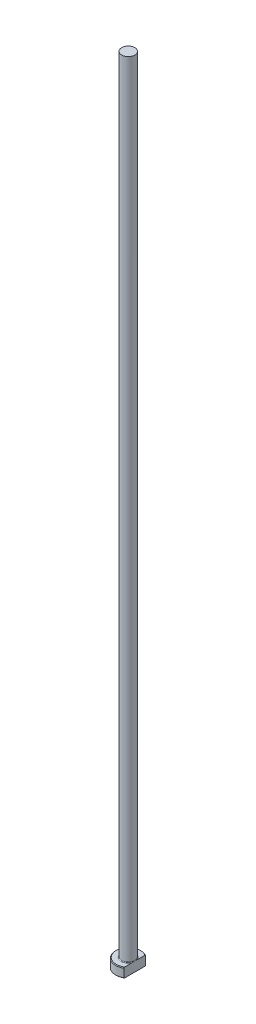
ISO-10303-21;
HEADER;
FILE_DESCRIPTION(('STEP AP214'),'2;1');
FILE_NAME('part.step','',(''),(''),'','','');
FILE_SCHEMA(('AUTOMOTIVE_DESIGN { 1 0 10303 214 1 1 1 1 }'));
ENDSEC;
DATA;
#1=APPLICATION_CONTEXT('core data for automotive mechanical design processes');
#2=APPLICATION_PROTOCOL_DEFINITION('international standard','automotive_design',2000,#1);
#3=PRODUCT_CONTEXT('',#1,'mechanical');
#4=PRODUCT('Part','Part','',(#3));
#5=PRODUCT_RELATED_PRODUCT_CATEGORY('part','',(#4));
#6=PRODUCT_DEFINITION_FORMATION('','',#4);
#7=PRODUCT_DEFINITION_CONTEXT('part definition',#1,'design');
#8=PRODUCT_DEFINITION('design','',#6,#7);
#9=PRODUCT_DEFINITION_SHAPE('','',#8);
#10=(LENGTH_UNIT() NAMED_UNIT(*) SI_UNIT(.MILLI.,.METRE.));
#11=(NAMED_UNIT(*) PLANE_ANGLE_UNIT() SI_UNIT($,.RADIAN.));
#12=(NAMED_UNIT(*) SI_UNIT($,.STERADIAN.) SOLID_ANGLE_UNIT());
#13=UNCERTAINTY_MEASURE_WITH_UNIT(LENGTH_MEASURE(1.E-05),#10,'distance_accuracy_value','');
#14=(GEOMETRIC_REPRESENTATION_CONTEXT(3) GLOBAL_UNCERTAINTY_ASSIGNED_CONTEXT((#13)) GLOBAL_UNIT_ASSIGNED_CONTEXT((#10,
#11,#12)) REPRESENTATION_CONTEXT('',''));
#15=CARTESIAN_POINT('',(0.,0.,0.));
#16=DIRECTION('',(0.,0.,1.));
#17=DIRECTION('',(1.,0.,0.));
#18=AXIS2_PLACEMENT_3D('',#15,#16,#17);
#19=CARTESIAN_POINT('',(0.,0.,0.));
#20=DIRECTION('',(0.,-1.,0.));
#21=DIRECTION('',(0.,0.,-1.));
#22=AXIS2_PLACEMENT_3D('',#19,#20,#21);
#23=PLANE('',#22);
#24=CARTESIAN_POINT('',(0.,0.,0.));
#25=DIRECTION('',(0.,-1.,0.));
#26=DIRECTION('',(0.,0.,-1.));
#27=AXIS2_PLACEMENT_3D('',#24,#25,#26);
#28=CIRCLE('',#27,3.79999999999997);
#29=CARTESIAN_POINT('',(2.04999999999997,0.,3.19960935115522));
#30=VERTEX_POINT('',#29);
#31=CARTESIAN_POINT('',(2.04999999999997,0.,-3.19960935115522));
#32=VERTEX_POINT('',#31);
#33=EDGE_CURVE('E98',#30,#32,#28,.T.);
#34=ORIENTED_EDGE('',*,*,#33,.T.);
#35=DIRECTION('',(0.,0.,1.));
#36=VECTOR('',#35,1.);
#37=CARTESIAN_POINT('',(2.04999999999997,0.,-3.4347488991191));
#38=LINE('',#37,#36);
#39=EDGE_CURVE('E83',#32,#30,#38,.T.);
#40=ORIENTED_EDGE('',*,*,#39,.T.);
#41=EDGE_LOOP('',(#34,#40));
#42=FACE_BOUND('',#41,.T.);
#43=ADVANCED_FACE('F32',(#42),#23,.T.);
#44=CARTESIAN_POINT('',(0.,259.958771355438,0.));
#45=DIRECTION('',(0.,1.,0.));
#46=DIRECTION('',(0.,0.,1.));
#47=AXIS2_PLACEMENT_3D('',#44,#45,#46);
#48=CYLINDRICAL_SURFACE('',#47,3.99999999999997);
#49=CARTESIAN_POINT('',(0.,2.80000000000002,0.));
#50=DIRECTION('',(0.,1.,0.));
#51=DIRECTION('',(0.,0.,1.));
#52=AXIS2_PLACEMENT_3D('',#49,#50,#51);
#53=CIRCLE('',#52,3.99999999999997);
#54=CARTESIAN_POINT('',(2.04999999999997,2.80000000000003,3.4347488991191));
#55=VERTEX_POINT('',#54);
#56=CARTESIAN_POINT('',(2.04999999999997,2.80000000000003,-3.4347488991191));
#57=VERTEX_POINT('',#56);
#58=EDGE_CURVE('E104',#55,#57,#53,.F.);
#59=ORIENTED_EDGE('',*,*,#58,.T.);
#60=DIRECTION('',(0.,-1.,0.));
#61=VECTOR('',#60,1.);
#62=CARTESIAN_POINT('',(2.04999999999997,250.,-3.4347488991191));
#63=LINE('',#62,#61);
#64=CARTESIAN_POINT('',(2.04999999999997,0.200000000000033,-3.4347488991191));
#65=VERTEX_POINT('',#64);
#66=EDGE_CURVE('E183',#57,#65,#63,.T.);
#67=ORIENTED_EDGE('',*,*,#66,.T.);
#68=CARTESIAN_POINT('',(0.,0.200000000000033,0.));
#69=DIRECTION('',(0.,-1.,0.));
#70=DIRECTION('',(0.,0.,-1.));
#71=AXIS2_PLACEMENT_3D('',#68,#69,#70);
#72=CIRCLE('',#71,3.99999999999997);
#73=CARTESIAN_POINT('',(2.04999999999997,0.200000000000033,3.4347488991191));
#74=VERTEX_POINT('',#73);
#75=EDGE_CURVE('E100',#65,#74,#72,.F.);
#76=ORIENTED_EDGE('',*,*,#75,.T.);
#77=DIRECTION('',(0.,-1.,0.));
#78=VECTOR('',#77,1.);
#79=CARTESIAN_POINT('',(2.04999999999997,250.,3.4347488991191));
#80=LINE('',#79,#78);
#81=EDGE_CURVE('E93',#55,#74,#80,.T.);
#82=ORIENTED_EDGE('',*,*,#81,.F.);
#83=EDGE_LOOP('',(#59,#67,#76,#82));
#84=FACE_BOUND('',#83,.T.);
#85=ADVANCED_FACE('F158',(#84),#48,.T.);
#86=CARTESIAN_POINT('',(-3.99999999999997,3.,0.));
#87=DIRECTION('',(0.,1.,0.));
#88=DIRECTION('',(0.,0.,1.));
#89=AXIS2_PLACEMENT_3D('',#86,#87,#88);
#90=PLANE('',#89);
#91=CARTESIAN_POINT('',(0.,3.,0.));
#92=DIRECTION('',(0.,1.,0.));
#93=DIRECTION('',(0.,0.,1.));
#94=AXIS2_PLACEMENT_3D('',#91,#92,#93);
#95=CIRCLE('',#94,3.8);
#96=CARTESIAN_POINT('',(2.04999999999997,3.,-3.19960935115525));
#97=VERTEX_POINT('',#96);
#98=CARTESIAN_POINT('',(2.04999999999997,3.,3.19960935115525));
#99=VERTEX_POINT('',#98);
#100=EDGE_CURVE('E178',#97,#99,#95,.T.);
#101=ORIENTED_EDGE('',*,*,#100,.T.);
#102=DIRECTION('',(0.,0.,-1.));
#103=VECTOR('',#102,1.);
#104=CARTESIAN_POINT('',(2.04999999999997,3.,0.));
#105=LINE('',#104,#103);
#106=CARTESIAN_POINT('',(2.04999999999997,2.99999999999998,0.927361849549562));
#107=VERTEX_POINT('',#106);
#108=EDGE_CURVE('E57',#99,#107,#105,.T.);
#109=ORIENTED_EDGE('',*,*,#108,.T.);
#110=CARTESIAN_POINT('',(0.,3.,0.));
#111=DIRECTION('',(0.,1.,0.));
#112=DIRECTION('',(0.,0.,1.));
#113=AXIS2_PLACEMENT_3D('',#110,#111,#112);
#114=CIRCLE('',#113,2.24999999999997);
#115=CARTESIAN_POINT('',(2.04999999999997,2.99999999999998,-0.927361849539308));
#116=VERTEX_POINT('',#115);
#117=EDGE_CURVE('E107',#107,#116,#114,.F.);
#118=ORIENTED_EDGE('',*,*,#117,.T.);
#119=EDGE_CURVE('E136',#116,#97,#105,.T.);
#120=ORIENTED_EDGE('',*,*,#119,.T.);
#121=EDGE_LOOP('',(#101,#109,#118,#120));
#122=FACE_BOUND('',#121,.T.);
#123=ADVANCED_FACE('F147',(#122),#90,.T.);
#124=CARTESIAN_POINT('',(0.,3.,0.));
#125=DIRECTION('',(0.,-1.,0.));
#126=DIRECTION('',(0.,0.,-1.));
#127=AXIS2_PLACEMENT_3D('',#124,#125,#126);
#128=CONICAL_SURFACE('',#127,3.8,0.785398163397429);
#129=ORIENTED_EDGE('',*,*,#58,.F.);
#130=CARTESIAN_POINT('',(2.04999999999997,-1.03146351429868,7.55839406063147));
#131=CARTESIAN_POINT('',(2.04999999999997,-0.873904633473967,7.39513453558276));
#132=CARTESIAN_POINT('',(2.04999999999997,-0.71651860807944,7.231707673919));
#133=CARTESIAN_POINT('',(2.04999999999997,-0.402187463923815,6.90442717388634));
#134=CARTESIAN_POINT('',(2.04999999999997,-0.245242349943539,6.74057353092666));
#135=CARTESIAN_POINT('',(2.04999999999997,0.0681734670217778,6.4122826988));
#136=CARTESIAN_POINT('',(2.04999999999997,0.224643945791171,6.24784529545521));
#137=CARTESIAN_POINT('',(2.04999999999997,0.536906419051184,5.91832867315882));
#138=CARTESIAN_POINT('',(2.04999999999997,0.692698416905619,5.75324945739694));
#139=CARTESIAN_POINT('',(2.04999999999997,1.0006425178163,5.42523572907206));
#140=CARTESIAN_POINT('',(2.04999999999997,1.15280992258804,5.26231559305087));
#141=CARTESIAN_POINT('',(2.04999999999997,1.45606307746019,4.93547204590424));
#142=CARTESIAN_POINT('',(2.04999999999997,1.6071488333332,4.77154864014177));
#143=CARTESIAN_POINT('',(2.04999999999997,1.90785570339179,4.4424154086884));
#144=CARTESIAN_POINT('',(2.04999999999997,2.05747707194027,4.27720581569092));
#145=CARTESIAN_POINT('',(2.04999999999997,2.35475209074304,3.94502824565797));
#146=CARTESIAN_POINT('',(2.04999999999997,2.50240579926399,3.77806032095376));
#147=CARTESIAN_POINT('',(2.04999999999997,2.74781587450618,3.49583336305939));
#148=CARTESIAN_POINT('',(2.04999999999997,2.84633082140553,3.38123477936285));
#149=CARTESIAN_POINT('',(2.04999999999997,3.04168132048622,3.15059166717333));
#150=CARTESIAN_POINT('',(2.04999999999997,3.13851670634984,3.03454699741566));
#151=CARTESIAN_POINT('',(2.04999999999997,3.33089134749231,2.79943466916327));
#152=CARTESIAN_POINT('',(2.04999999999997,3.4264079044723,2.68034837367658));
#153=CARTESIAN_POINT('',(2.04999999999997,3.61424509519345,2.43971344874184));
#154=CARTESIAN_POINT('',(2.04999999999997,3.70656652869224,2.31816544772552));
#155=CARTESIAN_POINT('',(2.04999999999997,3.88795970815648,2.06996820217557));
#156=CARTESIAN_POINT('',(2.04999999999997,3.97696605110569,1.94327085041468));
#157=CARTESIAN_POINT('',(2.04999999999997,4.14815278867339,1.68499648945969));
#158=CARTESIAN_POINT('',(2.04999999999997,4.23032373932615,1.55341308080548));
#159=CARTESIAN_POINT('',(2.04999999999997,4.34487781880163,1.35206756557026));
#160=CARTESIAN_POINT('',(2.04999999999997,4.38142455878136,1.28469323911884));
#161=CARTESIAN_POINT('',(2.04999999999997,4.45108462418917,1.14819983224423));
#162=CARTESIAN_POINT('',(2.04999999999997,4.48419730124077,1.07908042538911));
#163=CARTESIAN_POINT('',(2.04999999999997,4.57688716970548,0.869158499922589));
#164=CARTESIAN_POINT('',(2.04999999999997,4.63011331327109,0.725295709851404));
#165=CARTESIAN_POINT('',(2.04999999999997,4.68858147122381,0.509782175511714));
#166=CARTESIAN_POINT('',(2.04999999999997,4.70423178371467,0.440932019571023));
#167=CARTESIAN_POINT('',(2.04999999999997,4.72899377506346,0.302041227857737));
#168=CARTESIAN_POINT('',(2.04999999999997,4.73810615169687,0.232000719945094));
#169=CARTESIAN_POINT('',(2.04999999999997,4.74914212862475,0.0916144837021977));
#170=CARTESIAN_POINT('',(2.04999999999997,4.75109292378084,0.0212709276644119));
#171=CARTESIAN_POINT('',(2.04999999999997,4.7477366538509,-0.119244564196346));
#172=CARTESIAN_POINT('',(2.04999999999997,4.74242910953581,-0.189416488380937));
#173=CARTESIAN_POINT('',(2.04999999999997,4.72500657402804,-0.328355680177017));
#174=CARTESIAN_POINT('',(2.04999999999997,4.71294307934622,-0.397129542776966));
#175=CARTESIAN_POINT('',(2.04999999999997,4.68280191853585,-0.53333277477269));
#176=CARTESIAN_POINT('',(2.04999999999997,4.6647234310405,-0.600761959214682));
#177=CARTESIAN_POINT('',(2.04999999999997,4.62334379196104,-0.734440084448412));
#178=CARTESIAN_POINT('',(2.04999999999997,4.6000105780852,-0.800678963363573));
#179=CARTESIAN_POINT('',(2.04999999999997,4.54910792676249,-0.931471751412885));
#180=CARTESIAN_POINT('',(2.04999999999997,4.5215393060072,-0.996025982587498));
#181=CARTESIAN_POINT('',(2.04999999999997,4.43580994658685,-1.18273856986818));
#182=CARTESIAN_POINT('',(2.04999999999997,4.37300267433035,-1.30275656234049));
#183=CARTESIAN_POINT('',(2.04999999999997,4.23899016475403,-1.53805589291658));
#184=CARTESIAN_POINT('',(2.04999999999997,4.1677747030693,-1.65333122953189));
#185=CARTESIAN_POINT('',(2.04999999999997,4.01940383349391,-1.88059522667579));
#186=CARTESIAN_POINT('',(2.04999999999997,3.94222660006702,-1.9925695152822));
#187=CARTESIAN_POINT('',(2.04999999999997,3.78394545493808,-2.21359913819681));
#188=CARTESIAN_POINT('',(2.04999999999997,3.702843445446,-2.3226558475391));
#189=CARTESIAN_POINT('',(2.04999999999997,3.53672600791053,-2.53996457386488));
#190=CARTESIAN_POINT('',(2.04999999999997,3.45167369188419,-2.64818825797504));
#191=CARTESIAN_POINT('',(2.04999999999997,3.27939927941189,-2.8629058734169));
#192=CARTESIAN_POINT('',(2.04999999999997,3.19217696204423,-2.96939962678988));
#193=CARTESIAN_POINT('',(2.04999999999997,3.01630213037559,-3.1807695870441));
#194=CARTESIAN_POINT('',(2.04999999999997,2.92765349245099,-3.28564902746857));
#195=CARTESIAN_POINT('',(2.04999999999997,2.74908778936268,-3.49432359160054));
#196=CARTESIAN_POINT('',(2.04999999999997,2.65917070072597,-3.59811869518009));
#197=CARTESIAN_POINT('',(2.04999999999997,2.42106477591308,-3.87030922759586));
#198=CARTESIAN_POINT('',(2.04999999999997,2.27204417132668,-4.03797649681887));
#199=CARTESIAN_POINT('',(2.04999999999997,1.9721299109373,-4.37162983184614));
#200=CARTESIAN_POINT('',(2.04999999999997,1.82123620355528,-4.53761585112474));
#201=CARTESIAN_POINT('',(2.04999999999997,1.51793530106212,-4.86847799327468));
#202=CARTESIAN_POINT('',(2.04999999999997,1.36552684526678,-5.03335295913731));
#203=CARTESIAN_POINT('',(2.04999999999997,1.05967116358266,-5.36213642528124));
#204=CARTESIAN_POINT('',(2.04999999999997,0.906223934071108,-5.52604492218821));
#205=CARTESIAN_POINT('',(2.04999999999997,0.604770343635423,-5.84646863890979));
#206=CARTESIAN_POINT('',(2.04999999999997,0.456795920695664,-6.003013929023));
#207=CARTESIAN_POINT('',(2.04999999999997,0.160257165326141,-6.31554566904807));
#208=CARTESIAN_POINT('',(2.04999999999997,0.0116928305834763,-6.47153211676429));
#209=CARTESIAN_POINT('',(2.04999999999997,-0.285748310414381,-6.78287905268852));
#210=CARTESIAN_POINT('',(2.04999999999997,-0.434624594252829,-6.93824004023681));
#211=CARTESIAN_POINT('',(2.04999999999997,-0.73276964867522,-7.24858246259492));
#212=CARTESIAN_POINT('',(2.04999999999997,-0.882038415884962,-7.40356390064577));
#213=CARTESIAN_POINT('',(2.04999999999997,-1.03146351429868,-7.55839406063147));
#214=B_SPLINE_CURVE_WITH_KNOTS('',3,(#130,#131,#132,#133,#134,#135,#136,#137,#138,#139,#140,
#141,#142,#143,#144,#145,#146,#147,#148,#149,#150,#151,#152,#153,#154,#155,#156,#157,#158,#159,
#160,#161,#162,#163,#164,#165,#166,#167,#168,#169,#170,#171,#172,#173,#174,#175,#176,#177,#178,
#179,#180,#181,#182,#183,#184,#185,#186,#187,#188,#189,#190,#191,#192,#193,#194,#195,#196,#197,
#198,#199,#200,#201,#202,#203,#204,#205,#206,#207,#208,#209,#210,#211,#212,#213),.UNSPECIFIED.,
.F.,.F.,(4,2,2,2,2,2,2,2,2,2,2,2,2,2,2,2,2,2,2,2,2,2,2,2,2,2,2,2,2,2,2,2,2,2,2,2,2,2,2,2,2,4),
(0.,0.68066647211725,1.36134029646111,2.04229694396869,2.72325021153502,3.39203729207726,
4.06082080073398,4.72948600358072,5.39813136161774,5.85148716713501,6.30488761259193,
6.76282955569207,7.22065603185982,7.68503359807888,8.15004245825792,8.3798920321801,
8.60978492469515,9.06784199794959,9.27940643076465,9.49094828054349,9.70168600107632,
9.91243763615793,10.1216042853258,10.3307995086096,10.5413075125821,10.7517749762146,
11.1575695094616,11.5638626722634,11.9717209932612,12.3793835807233,12.7922829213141,
13.205224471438,13.6171880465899,14.0291592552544,14.7020968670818,15.3750530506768,
16.0486261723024,16.7222016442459,17.3684394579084,18.0146798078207,18.6602103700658,
19.3057354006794),.UNSPECIFIED.);
#215=EDGE_CURVE('E135',#55,#99,#214,.T.);
#216=ORIENTED_EDGE('',*,*,#215,.T.);
#217=ORIENTED_EDGE('',*,*,#100,.F.);
#218=EDGE_CURVE('E127',#97,#57,#214,.T.);
#219=ORIENTED_EDGE('',*,*,#218,.T.);
#220=EDGE_LOOP('',(#129,#216,#217,#219));
#221=FACE_BOUND('',#220,.T.);
#222=ADVANCED_FACE('F143',(#221),#128,.T.);
#223=CARTESIAN_POINT('',(0.,0.200000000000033,0.));
#224=DIRECTION('',(0.,1.,0.));
#225=DIRECTION('',(0.,0.,1.));
#226=AXIS2_PLACEMENT_3D('',#223,#224,#225);
#227=CONICAL_SURFACE('',#226,3.99999999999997,0.785398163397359);
#228=ORIENTED_EDGE('',*,*,#75,.F.);
#229=CARTESIAN_POINT('',(2.04999999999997,4.03146351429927,-7.55839406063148));
#230=CARTESIAN_POINT('',(2.04999999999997,3.87390463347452,-7.39513453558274));
#231=CARTESIAN_POINT('',(2.04999999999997,3.71651860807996,-7.23170767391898));
#232=CARTESIAN_POINT('',(2.04999999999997,3.40218746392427,-6.90442717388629));
#233=CARTESIAN_POINT('',(2.04999999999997,3.24524234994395,-6.74057353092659));
#234=CARTESIAN_POINT('',(2.04999999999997,2.93182653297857,-6.41228269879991));
#235=CARTESIAN_POINT('',(2.04999999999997,2.77535605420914,-6.2478452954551));
#236=CARTESIAN_POINT('',(2.04999999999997,2.46309358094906,-5.91832867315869));
#237=CARTESIAN_POINT('',(2.04999999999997,2.30730158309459,-5.75324945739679));
#238=CARTESIAN_POINT('',(2.04999999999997,1.99935748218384,-5.42523572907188));
#239=CARTESIAN_POINT('',(2.04999999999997,1.84719007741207,-5.26231559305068));
#240=CARTESIAN_POINT('',(2.04999999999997,1.54393692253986,-4.93547204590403));
#241=CARTESIAN_POINT('',(2.04999999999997,1.39285116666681,-4.77154864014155));
#242=CARTESIAN_POINT('',(2.04999999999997,1.09214429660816,-4.44241540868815));
#243=CARTESIAN_POINT('',(2.04999999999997,0.942522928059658,-4.27720581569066));
#244=CARTESIAN_POINT('',(2.04999999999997,0.645247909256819,-3.94502824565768));
#245=CARTESIAN_POINT('',(2.04999999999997,0.497594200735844,-3.77806032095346));
#246=CARTESIAN_POINT('',(2.04999999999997,0.252184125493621,-3.49583336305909));
#247=CARTESIAN_POINT('',(2.04999999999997,0.153669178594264,-3.38123477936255));
#248=CARTESIAN_POINT('',(2.04999999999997,-0.0416813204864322,-3.15059166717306));
#249=CARTESIAN_POINT('',(2.04999999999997,-0.138516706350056,-3.03454699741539));
#250=CARTESIAN_POINT('',(2.04999999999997,-0.330891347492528,-2.79943466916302));
#251=CARTESIAN_POINT('',(2.04999999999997,-0.426407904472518,-2.68034837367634));
#252=CARTESIAN_POINT('',(2.04999999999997,-0.614245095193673,-2.43971344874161));
#253=CARTESIAN_POINT('',(2.04999999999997,-0.70656652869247,-2.31816544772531));
#254=CARTESIAN_POINT('',(2.04999999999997,-0.887959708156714,-2.06996820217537));
#255=CARTESIAN_POINT('',(2.04999999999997,-0.976966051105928,-1.94327085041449));
#256=CARTESIAN_POINT('',(2.04999999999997,-1.14815278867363,-1.68499648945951));
#257=CARTESIAN_POINT('',(2.04999999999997,-1.2303237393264,-1.5534130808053));
#258=CARTESIAN_POINT('',(2.04999999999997,-1.34487781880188,-1.3520675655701));
#259=CARTESIAN_POINT('',(2.04999999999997,-1.38142455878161,-1.28469323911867));
#260=CARTESIAN_POINT('',(2.04999999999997,-1.45108462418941,-1.14819983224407));
#261=CARTESIAN_POINT('',(2.04999999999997,-1.48419730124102,-1.07908042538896));
#262=CARTESIAN_POINT('',(2.04999999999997,-1.57688716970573,-0.869158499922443));
#263=CARTESIAN_POINT('',(2.04999999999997,-1.63011331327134,-0.725295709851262));
#264=CARTESIAN_POINT('',(2.04999999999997,-1.68858147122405,-0.509782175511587));
#265=CARTESIAN_POINT('',(2.04999999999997,-1.7042317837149,-0.440932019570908));
#266=CARTESIAN_POINT('',(2.04999999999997,-1.72899377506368,-0.302041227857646));
#267=CARTESIAN_POINT('',(2.04999999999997,-1.73810615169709,-0.232000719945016));
#268=CARTESIAN_POINT('',(2.04999999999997,-1.74914212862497,-0.091614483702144));
#269=CARTESIAN_POINT('',(2.04999999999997,-1.75109292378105,-0.0212709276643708));
#270=CARTESIAN_POINT('',(2.04999999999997,-1.74773665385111,0.119244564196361));
#271=CARTESIAN_POINT('',(2.04999999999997,-1.74242910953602,0.18941648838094));
#272=CARTESIAN_POINT('',(2.04999999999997,-1.72500657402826,0.328355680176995));
#273=CARTESIAN_POINT('',(2.04999999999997,-1.71294307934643,0.397129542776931));
#274=CARTESIAN_POINT('',(2.04999999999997,-1.68280191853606,0.533332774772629));
#275=CARTESIAN_POINT('',(2.04999999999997,-1.66472343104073,0.600761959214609));
#276=CARTESIAN_POINT('',(2.04999999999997,-1.62334379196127,0.734440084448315));
#277=CARTESIAN_POINT('',(2.04999999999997,-1.60001057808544,0.800678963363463));
#278=CARTESIAN_POINT('',(2.04999999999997,-1.54910792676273,0.931471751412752));
#279=CARTESIAN_POINT('',(2.04999999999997,-1.52153930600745,0.996025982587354));
#280=CARTESIAN_POINT('',(2.04999999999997,-1.43580994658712,1.18273856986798));
#281=CARTESIAN_POINT('',(2.04999999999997,-1.37300267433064,1.30275656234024));
#282=CARTESIAN_POINT('',(2.04999999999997,-1.23899016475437,1.53805589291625));
#283=CARTESIAN_POINT('',(2.04999999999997,-1.16777470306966,1.65333122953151));
#284=CARTESIAN_POINT('',(2.04999999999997,-1.01940383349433,1.88059522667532));
#285=CARTESIAN_POINT('',(2.04999999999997,-0.942226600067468,1.99256951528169));
#286=CARTESIAN_POINT('',(2.04999999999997,-0.783945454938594,2.21359913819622));
#287=CARTESIAN_POINT('',(2.04999999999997,-0.70284344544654,2.32265584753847));
#288=CARTESIAN_POINT('',(2.04999999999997,-0.53672600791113,2.53996457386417));
#289=CARTESIAN_POINT('',(2.04999999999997,-0.45167369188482,2.64818825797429));
#290=CARTESIAN_POINT('',(2.04999999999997,-0.279399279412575,2.86290587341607));
#291=CARTESIAN_POINT('',(2.04999999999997,-0.192176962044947,2.969399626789));
#292=CARTESIAN_POINT('',(2.04999999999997,-0.016302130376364,3.18076958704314));
#293=CARTESIAN_POINT('',(2.04999999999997,0.0723465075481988,3.28564902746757));
#294=CARTESIAN_POINT('',(2.04999999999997,0.250912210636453,3.49432359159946));
#295=CARTESIAN_POINT('',(2.04999999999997,0.340829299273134,3.59811869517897));
#296=CARTESIAN_POINT('',(2.04999999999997,0.578935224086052,3.87030922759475));
#297=CARTESIAN_POINT('',(2.04999999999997,0.72795582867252,4.03797649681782));
#298=CARTESIAN_POINT('',(2.04999999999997,1.02787008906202,4.3716298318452));
#299=CARTESIAN_POINT('',(2.04999999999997,1.17876379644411,4.53761585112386));
#300=CARTESIAN_POINT('',(2.04999999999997,1.4820646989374,4.86847799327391));
#301=CARTESIAN_POINT('',(2.04999999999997,1.6344731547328,5.03335295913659));
#302=CARTESIAN_POINT('',(2.04999999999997,1.94032883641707,5.36213642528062));
#303=CARTESIAN_POINT('',(2.04999999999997,2.09377606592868,5.52604492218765));
#304=CARTESIAN_POINT('',(2.04999999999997,2.3952296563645,5.84646863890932));
#305=CARTESIAN_POINT('',(2.04999999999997,2.54320407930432,6.00301392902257));
#306=CARTESIAN_POINT('',(2.04999999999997,2.83974283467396,6.31554566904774));
#307=CARTESIAN_POINT('',(2.04999999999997,2.98830716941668,6.47153211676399));
#308=CARTESIAN_POINT('',(2.04999999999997,3.28574831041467,6.78287905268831));
#309=CARTESIAN_POINT('',(2.04999999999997,3.43462459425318,6.93824004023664));
#310=CARTESIAN_POINT('',(2.04999999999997,3.73276964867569,7.24858246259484));
#311=CARTESIAN_POINT('',(2.04999999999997,3.88203841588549,7.40356390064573));
#312=CARTESIAN_POINT('',(2.04999999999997,4.03146351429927,7.55839406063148));
#313=B_SPLINE_CURVE_WITH_KNOTS('',3,(#229,#230,#231,#232,#233,#234,#235,#236,#237,#238,#239,
#240,#241,#242,#243,#244,#245,#246,#247,#248,#249,#250,#251,#252,#253,#254,#255,#256,#257,#258,
#259,#260,#261,#262,#263,#264,#265,#266,#267,#268,#269,#270,#271,#272,#273,#274,#275,#276,#277,
#278,#279,#280,#281,#282,#283,#284,#285,#286,#287,#288,#289,#290,#291,#292,#293,#294,#295,#296,
#297,#298,#299,#300,#301,#302,#303,#304,#305,#306,#307,#308,#309,#310,#311,#312),.UNSPECIFIED.,
.F.,.F.,(4,2,2,2,2,2,2,2,2,2,2,2,2,2,2,2,2,2,2,2,2,2,2,2,2,2,2,2,2,2,2,2,2,2,2,2,2,2,2,2,2,4),
(0.,0.680666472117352,1.36134029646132,2.042296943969,2.72325021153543,3.39203729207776,
4.06082080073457,4.7294860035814,5.39813136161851,5.85148716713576,6.30488761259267,
6.76282955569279,7.22065603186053,7.68503359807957,8.15004245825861,8.37989203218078,
8.60978492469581,9.06784199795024,9.27940643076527,9.49094828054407,9.70168600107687,
9.91243763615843,10.1216042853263,10.33079950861,10.5413075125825,10.751774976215,
11.1575695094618,11.5638626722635,11.9717209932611,12.3793835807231,12.7922829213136,
13.2052244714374,13.6171880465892,14.0291592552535,14.7020968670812,15.3750530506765,
16.0486261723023,16.722201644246,17.3684394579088,18.0146798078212,18.6602103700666,
19.3057354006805),.UNSPECIFIED.);
#314=EDGE_CURVE('E86',#65,#32,#313,.T.);
#315=ORIENTED_EDGE('',*,*,#314,.T.);
#316=ORIENTED_EDGE('',*,*,#33,.F.);
#317=EDGE_CURVE('E89',#30,#74,#313,.T.);
#318=ORIENTED_EDGE('',*,*,#317,.T.);
#319=EDGE_LOOP('',(#228,#315,#316,#318));
#320=FACE_BOUND('',#319,.T.);
#321=ADVANCED_FACE('F97',(#320),#227,.T.);
#322=CARTESIAN_POINT('',(0.,3.19999999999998,0.));
#323=DIRECTION('',(0.,1.,0.));
#324=DIRECTION('',(0.,0.,1.));
#325=AXIS2_PLACEMENT_3D('',#322,#323,#324);
#326=TOROIDAL_SURFACE('',#325,2.24999999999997,0.2);
#327=CARTESIAN_POINT('',(2.04999999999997,3.19999999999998,0.));
#328=CARTESIAN_POINT('',(2.04999999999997,3.20000050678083,1.11433978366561E-10));
#329=CARTESIAN_POINT('',(2.04999999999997,3.20000101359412,-1.49199173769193E-07));
#330=CARTESIAN_POINT('',(2.04999999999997,3.20000197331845,-5.90092849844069E-07));
#331=CARTESIAN_POINT('',(2.04999999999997,3.20000242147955,-8.89334890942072E-07));
#332=CARTESIAN_POINT('',(2.04999999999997,3.200003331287,-1.60386249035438E-06));
#333=CARTESIAN_POINT('',(2.04999999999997,3.20000378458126,-2.02988262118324E-06));
#334=CARTESIAN_POINT('',(2.04999999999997,3.20000461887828,-2.92958555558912E-06));
#335=CARTESIAN_POINT('',(2.04999999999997,3.20000500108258,-3.40221864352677E-06));
#336=CARTESIAN_POINT('',(2.04999999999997,3.20000635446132,-5.1677876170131E-06));
#337=CARTESIAN_POINT('',(2.04999999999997,3.20000725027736,-6.52020726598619E-06));
#338=CARTESIAN_POINT('',(2.04999999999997,3.20000878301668,-9.25136186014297E-06));
#339=CARTESIAN_POINT('',(2.04999999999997,3.20000943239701,-1.06234618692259E-05));
#340=CARTESIAN_POINT('',(2.04999999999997,3.20001203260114,-1.6232674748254E-05));
#341=CARTESIAN_POINT('',(2.04999999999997,3.20001389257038,-2.05163580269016E-05));
#342=CARTESIAN_POINT('',(2.04999999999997,3.20001674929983,-2.87532844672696E-05));
#343=CARTESIAN_POINT('',(2.04999999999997,3.20001782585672,-3.2679073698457E-05));
#344=CARTESIAN_POINT('',(2.04999999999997,3.20002546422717,-6.12436551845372E-05));
#345=CARTESIAN_POINT('',(2.04999999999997,3.20003105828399,-8.60941961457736E-05));
#346=CARTESIAN_POINT('',(2.04999999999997,3.20005552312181,-0.000183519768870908));
#347=CARTESIAN_POINT('',(2.04999999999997,3.20007904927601,-0.000254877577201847));
#348=CARTESIAN_POINT('',(2.04999999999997,3.20016988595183,-0.000535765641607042));
#349=CARTESIAN_POINT('',(2.04999999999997,3.20023402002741,-0.000746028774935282));
#350=CARTESIAN_POINT('',(2.04999999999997,3.20048927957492,-0.0015758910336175));
#351=CARTESIAN_POINT('',(2.04999999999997,3.20068429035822,-0.00219457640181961));
#352=CARTESIAN_POINT('',(2.04999999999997,3.20148922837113,-0.00475596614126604));
#353=CARTESIAN_POINT('',(2.04999999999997,3.20209434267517,-0.0066998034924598));
#354=CARTESIAN_POINT('',(2.04999999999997,3.20817248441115,-0.026215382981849));
#355=CARTESIAN_POINT('',(2.04999999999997,3.21366777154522,-0.0437820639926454));
#356=CARTESIAN_POINT('',(2.04999999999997,3.22440004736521,-0.0782469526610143));
#357=CARTESIAN_POINT('',(2.04999999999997,3.22963878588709,-0.0951446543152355));
#358=CARTESIAN_POINT('',(2.04999999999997,3.24070596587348,-0.13103721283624));
#359=CARTESIAN_POINT('',(2.04999999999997,3.24652762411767,-0.150034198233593));
#360=CARTESIAN_POINT('',(2.04999999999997,3.25812563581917,-0.188263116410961));
#361=CARTESIAN_POINT('',(2.04999999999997,3.26390084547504,-0.207495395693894));
#362=CARTESIAN_POINT('',(2.04999999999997,3.27784177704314,-0.254568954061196));
#363=CARTESIAN_POINT('',(2.04999999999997,3.28592802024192,-0.282433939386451));
#364=CARTESIAN_POINT('',(2.04999999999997,3.30147824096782,-0.337598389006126));
#365=CARTESIAN_POINT('',(2.04999999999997,3.30895263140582,-0.364894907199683));
#366=CARTESIAN_POINT('',(2.04999999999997,3.32487272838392,-0.425333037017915));
#367=CARTESIAN_POINT('',(2.04999999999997,3.33319621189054,-0.458507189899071));
#368=CARTESIAN_POINT('',(2.04999999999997,3.34887938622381,-0.525344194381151));
#369=CARTESIAN_POINT('',(2.04999999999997,3.35623148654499,-0.559008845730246));
#370=CARTESIAN_POINT('',(2.04999999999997,3.3700913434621,-0.629073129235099));
#371=CARTESIAN_POINT('',(2.04999999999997,3.37649834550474,-0.665493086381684));
#372=CARTESIAN_POINT('',(2.04999999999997,3.38732437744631,-0.738624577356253));
#373=CARTESIAN_POINT('',(2.04999999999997,3.39174404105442,-0.775336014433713));
#374=CARTESIAN_POINT('',(2.04999999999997,3.39842323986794,-0.853869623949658));
#375=CARTESIAN_POINT('',(2.04999999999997,3.40031921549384,-0.895724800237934));
#376=CARTESIAN_POINT('',(2.04999999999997,3.3995967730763,-0.978802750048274));
#377=CARTESIAN_POINT('',(2.04999999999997,3.39705088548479,-1.02002480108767));
#378=CARTESIAN_POINT('',(2.04999999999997,3.38815866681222,-1.08355885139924));
#379=CARTESIAN_POINT('',(2.04999999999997,3.38399133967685,-1.10617047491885));
#380=CARTESIAN_POINT('',(2.04999999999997,3.37312056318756,-1.1508734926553));
#381=CARTESIAN_POINT('',(2.04999999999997,3.36641150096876,-1.17296361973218));
#382=CARTESIAN_POINT('',(2.04999999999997,3.35241630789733,-1.20879754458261));
#383=CARTESIAN_POINT('',(2.04999999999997,3.34604663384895,-1.22289572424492));
#384=CARTESIAN_POINT('',(2.04999999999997,3.33145856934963,-1.25010305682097));
#385=CARTESIAN_POINT('',(2.04999999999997,3.32324484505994,-1.26321459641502));
#386=CARTESIAN_POINT('',(2.04999999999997,3.30807074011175,-1.28311183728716));
#387=CARTESIAN_POINT('',(2.04999999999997,3.30180162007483,-1.29042146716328));
#388=CARTESIAN_POINT('',(2.04999999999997,3.28827985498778,-1.30407693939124));
#389=CARTESIAN_POINT('',(2.04999999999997,3.28102850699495,-1.31042402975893));
#390=CARTESIAN_POINT('',(2.04999999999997,3.26730073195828,-1.32042781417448));
#391=CARTESIAN_POINT('',(2.04999999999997,3.26103227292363,-1.32436729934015));
#392=CARTESIAN_POINT('',(2.04999999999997,3.24793774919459,-1.33118589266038));
#393=CARTESIAN_POINT('',(2.04999999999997,3.2411121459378,-1.3340658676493));
#394=CARTESIAN_POINT('',(2.04999999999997,3.22696550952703,-1.33854399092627));
#395=CARTESIAN_POINT('',(2.04999999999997,3.21964010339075,-1.34012865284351));
#396=CARTESIAN_POINT('',(2.04999999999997,3.20482104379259,-1.34178557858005));
#397=CARTESIAN_POINT('',(2.04999999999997,3.19732755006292,-1.34185922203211));
#398=CARTESIAN_POINT('',(2.04999999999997,3.18362821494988,-1.34059674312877));
#399=CARTESIAN_POINT('',(2.04999999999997,3.17740126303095,-1.3394752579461));
#400=CARTESIAN_POINT('',(2.04999999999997,3.16521180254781,-1.33624238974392));
#401=CARTESIAN_POINT('',(2.04999999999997,3.15924940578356,-1.33413059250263));
#402=CARTESIAN_POINT('',(2.04999999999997,3.14588128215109,-1.32826056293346));
#403=CARTESIAN_POINT('',(2.04999999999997,3.13861186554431,-1.324193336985));
#404=CARTESIAN_POINT('',(2.04999999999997,3.1248230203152,-1.314942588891));
#405=CARTESIAN_POINT('',(2.04999999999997,3.11830521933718,-1.30975671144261));
#406=CARTESIAN_POINT('',(2.04999999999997,3.10285879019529,-1.29569016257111));
#407=CARTESIAN_POINT('',(2.04999999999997,3.09441467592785,-1.28628110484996));
#408=CARTESIAN_POINT('',(2.04999999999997,3.07905572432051,-1.26631405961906));
#409=CARTESIAN_POINT('',(2.04999999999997,3.07214294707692,-1.25575455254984));
#410=CARTESIAN_POINT('',(2.04999999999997,3.05475343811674,-1.22547453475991));
#411=CARTESIAN_POINT('',(2.04999999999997,3.04564540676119,-1.20497519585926));
#412=CARTESIAN_POINT('',(2.04999999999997,3.03036658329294,-1.16279344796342));
#413=CARTESIAN_POINT('',(2.04999999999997,3.02422151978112,-1.14110243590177));
#414=CARTESIAN_POINT('',(2.04999999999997,3.01411308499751,-1.09654657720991));
#415=CARTESIAN_POINT('',(2.04999999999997,3.01022074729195,-1.07366604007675));
#416=CARTESIAN_POINT('',(2.04999999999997,3.00438595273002,-1.02762855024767));
#417=CARTESIAN_POINT('',(2.04999999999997,3.00244735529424,-1.00447114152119));
#418=CARTESIAN_POINT('',(2.04999999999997,2.99907945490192,-0.936481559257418));
#419=CARTESIAN_POINT('',(2.04999999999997,2.99980550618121,-0.891546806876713));
#420=CARTESIAN_POINT('',(2.04999999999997,3.00639312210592,-0.785106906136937));
#421=CARTESIAN_POINT('',(2.04999999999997,3.01408723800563,-0.723739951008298));
#422=CARTESIAN_POINT('',(2.04999999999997,3.03471721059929,-0.600423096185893));
#423=CARTESIAN_POINT('',(2.04999999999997,3.04777621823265,-0.538495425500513));
#424=CARTESIAN_POINT('',(2.04999999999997,3.07250330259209,-0.435218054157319));
#425=CARTESIAN_POINT('',(2.04999999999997,3.08327201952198,-0.393644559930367));
#426=CARTESIAN_POINT('',(2.04999999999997,3.1057691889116,-0.311244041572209));
#427=CARTESIAN_POINT('',(2.04999999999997,3.117485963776,-0.270413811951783));
#428=CARTESIAN_POINT('',(2.04999999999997,3.14023315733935,-0.193479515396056));
#429=CARTESIAN_POINT('',(2.04999999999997,3.15119500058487,-0.157354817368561));
#430=CARTESIAN_POINT('',(2.04999999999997,3.17387809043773,-0.083701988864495));
#431=CARTESIAN_POINT('',(2.04999999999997,3.18561198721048,-0.0461776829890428));
#432=CARTESIAN_POINT('',(2.04999999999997,3.19790660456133,-0.00669647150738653));
#433=CARTESIAN_POINT('',(2.04999999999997,3.19851281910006,-0.00474933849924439));
#434=CARTESIAN_POINT('',(2.04999999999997,3.19931801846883,-0.00218718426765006));
#435=CARTESIAN_POINT('',(2.04999999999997,3.19951222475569,-0.00157103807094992));
#436=CARTESIAN_POINT('',(2.04999999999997,3.1997665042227,-0.000744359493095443));
#437=CARTESIAN_POINT('',(2.04999999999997,3.1998304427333,-0.000534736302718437));
#438=CARTESIAN_POINT('',(2.04999999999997,3.19992104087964,-0.000254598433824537));
#439=CARTESIAN_POINT('',(2.04999999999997,3.19994453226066,-0.000183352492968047));
#440=CARTESIAN_POINT('',(2.04999999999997,3.19996896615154,-8.60574042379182E-05));
#441=CARTESIAN_POINT('',(2.04999999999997,3.19997455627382,-6.12234779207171E-05));
#442=CARTESIAN_POINT('',(2.04999999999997,3.19998218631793,-3.26756404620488E-05));
#443=CARTESIAN_POINT('',(2.04999999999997,3.19998326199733,-2.87508616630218E-05));
#444=CARTESIAN_POINT('',(2.04999999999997,3.19998611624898,-2.05159271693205E-05));
#445=CARTESIAN_POINT('',(2.04999999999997,3.19998797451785,-1.62331737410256E-05));
#446=CARTESIAN_POINT('',(2.04999999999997,3.19999057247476,-1.06248953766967E-05));
#447=CARTESIAN_POINT('',(2.04999999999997,3.19999122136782,-9.25287084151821E-06));
#448=CARTESIAN_POINT('',(2.04999999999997,3.19999275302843,-6.52177957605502E-06));
#449=CARTESIAN_POINT('',(2.04999999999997,3.19999364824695,-5.16933999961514E-06));
#450=CARTESIAN_POINT('',(2.04999999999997,3.19999500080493,-3.40363971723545E-06));
#451=CARTESIAN_POINT('',(2.04999999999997,3.19999538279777,-2.93094612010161E-06));
#452=CARTESIAN_POINT('',(2.04999999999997,3.19999621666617,-2.03108406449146E-06));
#453=CARTESIAN_POINT('',(2.04999999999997,3.19999666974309,-1.60496444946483E-06));
#454=CARTESIAN_POINT('',(2.04999999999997,3.19999757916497,-8.90199500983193E-07));
#455=CARTESIAN_POINT('',(2.04999999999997,3.19999802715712,-5.90826803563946E-07));
#456=CARTESIAN_POINT('',(2.04999999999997,3.19999898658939,-1.49609897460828E-07));
#457=CARTESIAN_POINT('',(2.04999999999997,3.19999949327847,-1.11420931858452E-10));
#458=CARTESIAN_POINT('',(2.04999999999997,3.19999999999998,0.));
#459=B_SPLINE_CURVE_WITH_KNOTS('',3,(#327,#328,#329,#330,#331,#332,#333,#334,#335,#336,#337,
#338,#339,#340,#341,#342,#343,#344,#345,#346,#347,#348,#349,#350,#351,#352,#353,#354,#355,#356,
#357,#358,#359,#360,#361,#362,#363,#364,#365,#366,#367,#368,#369,#370,#371,#372,#373,#374,#375,
#376,#377,#378,#379,#380,#381,#382,#383,#384,#385,#386,#387,#388,#389,#390,#391,#392,#393,#394,
#395,#396,#397,#398,#399,#400,#401,#402,#403,#404,#405,#406,#407,#408,#409,#410,#411,#412,#413,
#414,#415,#416,#417,#418,#419,#420,#421,#422,#423,#424,#425,#426,#427,#428,#429,#430,#431,#432,
#433,#434,#435,#436,#437,#438,#439,#440,#441,#442,#443,#444,#445,#446,#447,#448,#449,#450,#451,
#452,#453,#454,#455,#456,#457,#458),.UNSPECIFIED.,.T.,.F.,(4,2,2,2,2,2,2,2,2,2,2,2,2,2,2,2,2,2,
2,2,2,2,2,2,2,2,2,2,2,2,2,2,2,2,2,2,2,2,2,2,2,2,2,2,2,2,2,2,2,2,2,2,2,2,2,2,2,2,2,2,2,2,2,2,2,
4),(0.,1.52408153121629E-06,3.13545629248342E-06,4.99238279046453E-06,6.81430914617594E-06,
1.16602223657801E-05,1.62106020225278E-05,3.01878492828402E-05,4.23839441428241E-05,
0.000118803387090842,0.000343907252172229,0.00100368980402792,0.0029493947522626,
0.00905734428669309,0.0642734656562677,0.117347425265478,0.176954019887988,0.237195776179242,
0.324236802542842,0.409137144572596,0.511731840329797,0.615085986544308,0.725981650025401,
0.836841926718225,0.962382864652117,1.08589300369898,1.15477424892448,1.22380849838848,
1.27012487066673,1.31632533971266,1.34514229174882,1.37392155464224,1.3960524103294,
1.41816511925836,1.44050522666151,1.46282493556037,1.48171899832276,1.50062097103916,
1.52547167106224,1.55037521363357,1.58808905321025,1.62585332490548,1.69277250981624,
1.76026275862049,1.82977909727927,1.89943249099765,2.03394841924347,2.21916675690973,
2.40889807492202,2.5377192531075,2.66514307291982,2.77839635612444,2.89633906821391,
2.90245742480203,2.90439514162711,2.9050529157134,2.90527766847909,2.90535403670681,
2.90536622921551,2.905380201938,2.90538475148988,2.90538959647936,2.90539141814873,
2.90539327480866,2.9053948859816,2.90539640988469),.UNSPECIFIED.);
#460=CARTESIAN_POINT('',(2.04999999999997,3.19999999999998,0.));
#461=VERTEX_POINT('',#460);
#462=EDGE_CURVE('E11',#116,#461,#459,.T.);
#463=ORIENTED_EDGE('',*,*,#462,.F.);
#464=ORIENTED_EDGE('',*,*,#117,.F.);
#465=CARTESIAN_POINT('',(2.04999999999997,3.19999999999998,0.));
#466=CARTESIAN_POINT('',(2.04999999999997,3.19999949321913,-1.11434018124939E-10));
#467=CARTESIAN_POINT('',(2.04999999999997,3.19999898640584,1.49199173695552E-07));
#468=CARTESIAN_POINT('',(2.04999999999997,3.19999802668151,5.90092849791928E-07));
#469=CARTESIAN_POINT('',(2.04999999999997,3.19999757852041,8.89334890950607E-07));
#470=CARTESIAN_POINT('',(2.04999999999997,3.19999666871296,1.603862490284E-06));
#471=CARTESIAN_POINT('',(2.04999999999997,3.1999962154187,2.02988262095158E-06));
#472=CARTESIAN_POINT('',(2.04999999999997,3.19999538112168,2.92958555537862E-06));
#473=CARTESIAN_POINT('',(2.04999999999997,3.19999499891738,3.40221864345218E-06));
#474=CARTESIAN_POINT('',(2.04999999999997,3.19999364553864,5.16778761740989E-06));
#475=CARTESIAN_POINT('',(2.04999999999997,3.1999927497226,6.52020726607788E-06));
#476=CARTESIAN_POINT('',(2.04999999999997,3.19999121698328,9.25136186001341E-06));
#477=CARTESIAN_POINT('',(2.04999999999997,3.19999056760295,1.06234618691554E-05));
#478=CARTESIAN_POINT('',(2.04999999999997,3.19998796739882,1.62326747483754E-05));
#479=CARTESIAN_POINT('',(2.04999999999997,3.19998610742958,2.05163580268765E-05));
#480=CARTESIAN_POINT('',(2.04999999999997,3.19998325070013,2.8753284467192E-05));
#481=CARTESIAN_POINT('',(2.04999999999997,3.19998217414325,3.26790736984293E-05));
#482=CARTESIAN_POINT('',(2.04999999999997,3.19997453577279,6.12436551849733E-05));
#483=CARTESIAN_POINT('',(2.04999999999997,3.19996894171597,8.60941961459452E-05));
#484=CARTESIAN_POINT('',(2.04999999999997,3.19994447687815,0.000183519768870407));
#485=CARTESIAN_POINT('',(2.04999999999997,3.19992095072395,0.00025487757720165));
#486=CARTESIAN_POINT('',(2.04999999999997,3.19983011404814,0.000535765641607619));
#487=CARTESIAN_POINT('',(2.04999999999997,3.19976597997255,0.000746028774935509));
#488=CARTESIAN_POINT('',(2.04999999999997,3.19951072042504,0.00157589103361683));
#489=CARTESIAN_POINT('',(2.04999999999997,3.19931570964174,0.00219457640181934));
#490=CARTESIAN_POINT('',(2.04999999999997,3.19851077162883,0.00475596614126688));
#491=CARTESIAN_POINT('',(2.04999999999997,3.19790565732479,0.00669980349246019));
#492=CARTESIAN_POINT('',(2.04999999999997,3.1918275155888,0.0262153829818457));
#493=CARTESIAN_POINT('',(2.04999999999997,3.18633222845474,0.0437820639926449));
#494=CARTESIAN_POINT('',(2.04999999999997,3.17559995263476,0.0782469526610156));
#495=CARTESIAN_POINT('',(2.04999999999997,3.17036121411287,0.0951446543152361));
#496=CARTESIAN_POINT('',(2.04999999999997,3.15929403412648,0.13103721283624));
#497=CARTESIAN_POINT('',(2.04999999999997,3.15347237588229,0.150034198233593));
#498=CARTESIAN_POINT('',(2.04999999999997,3.14187436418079,0.188263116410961));
#499=CARTESIAN_POINT('',(2.04999999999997,3.13609915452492,0.207495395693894));
#500=CARTESIAN_POINT('',(2.04999999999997,3.12215822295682,0.254568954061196));
#501=CARTESIAN_POINT('',(2.04999999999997,3.11407197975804,0.282433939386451));
#502=CARTESIAN_POINT('',(2.04999999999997,3.09852175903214,0.337598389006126));
#503=CARTESIAN_POINT('',(2.04999999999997,3.09104736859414,0.364894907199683));
#504=CARTESIAN_POINT('',(2.04999999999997,3.07512727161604,0.425333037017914));
#505=CARTESIAN_POINT('',(2.04999999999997,3.06680378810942,0.458507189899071));
#506=CARTESIAN_POINT('',(2.04999999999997,3.05112061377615,0.525344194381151));
#507=CARTESIAN_POINT('',(2.04999999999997,3.04376851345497,0.559008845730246));
#508=CARTESIAN_POINT('',(2.04999999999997,3.02990865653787,0.629073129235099));
#509=CARTESIAN_POINT('',(2.04999999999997,3.02350165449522,0.665493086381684));
#510=CARTESIAN_POINT('',(2.04999999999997,3.01267562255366,0.738624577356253));
#511=CARTESIAN_POINT('',(2.04999999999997,3.00825595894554,0.775336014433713));
#512=CARTESIAN_POINT('',(2.04999999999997,3.00157676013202,0.853869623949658));
#513=CARTESIAN_POINT('',(2.04999999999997,2.99968078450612,0.895724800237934));
#514=CARTESIAN_POINT('',(2.04999999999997,3.00040322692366,0.978802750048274));
#515=CARTESIAN_POINT('',(2.04999999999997,3.00294911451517,1.02002480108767));
#516=CARTESIAN_POINT('',(2.04999999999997,3.01184133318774,1.08355885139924));
#517=CARTESIAN_POINT('',(2.04999999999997,3.01600866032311,1.10617047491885));
#518=CARTESIAN_POINT('',(2.04999999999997,3.0268794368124,1.1508734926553));
#519=CARTESIAN_POINT('',(2.04999999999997,3.0335884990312,1.17296361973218));
#520=CARTESIAN_POINT('',(2.04999999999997,3.04758369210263,1.20879754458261));
#521=CARTESIAN_POINT('',(2.04999999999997,3.05395336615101,1.22289572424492));
#522=CARTESIAN_POINT('',(2.04999999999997,3.06854143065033,1.25010305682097));
#523=CARTESIAN_POINT('',(2.04999999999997,3.07675515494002,1.26321459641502));
#524=CARTESIAN_POINT('',(2.04999999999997,3.09192925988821,1.28311183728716));
#525=CARTESIAN_POINT('',(2.04999999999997,3.09819837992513,1.29042146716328));
#526=CARTESIAN_POINT('',(2.04999999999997,3.11172014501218,1.30407693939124));
#527=CARTESIAN_POINT('',(2.04999999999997,3.11897149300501,1.31042402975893));
#528=CARTESIAN_POINT('',(2.04999999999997,3.13269926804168,1.32042781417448));
#529=CARTESIAN_POINT('',(2.04999999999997,3.13896772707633,1.32436729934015));
#530=CARTESIAN_POINT('',(2.04999999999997,3.15206225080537,1.33118589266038));
#531=CARTESIAN_POINT('',(2.04999999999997,3.15888785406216,1.3340658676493));
#532=CARTESIAN_POINT('',(2.04999999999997,3.17303449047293,1.33854399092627));
#533=CARTESIAN_POINT('',(2.04999999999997,3.18035989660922,1.34012865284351));
#534=CARTESIAN_POINT('',(2.04999999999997,3.19517895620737,1.34178557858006));
#535=CARTESIAN_POINT('',(2.04999999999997,3.20267244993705,1.34185922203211));
#536=CARTESIAN_POINT('',(2.04999999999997,3.21637178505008,1.34059674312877));
#537=CARTESIAN_POINT('',(2.04999999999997,3.22259873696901,1.3394752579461));
#538=CARTESIAN_POINT('',(2.04999999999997,3.23478819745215,1.33624238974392));
#539=CARTESIAN_POINT('',(2.04999999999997,3.2407505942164,1.33413059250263));
#540=CARTESIAN_POINT('',(2.04999999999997,3.25411871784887,1.32826056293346));
#541=CARTESIAN_POINT('',(2.04999999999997,3.26138813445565,1.324193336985));
#542=CARTESIAN_POINT('',(2.04999999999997,3.27517697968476,1.314942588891));
#543=CARTESIAN_POINT('',(2.04999999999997,3.28169478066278,1.30975671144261));
#544=CARTESIAN_POINT('',(2.04999999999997,3.29714120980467,1.29569016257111));
#545=CARTESIAN_POINT('',(2.04999999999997,3.30558532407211,1.28628110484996));
#546=CARTESIAN_POINT('',(2.04999999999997,3.32094427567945,1.26631405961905));
#547=CARTESIAN_POINT('',(2.04999999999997,3.32785705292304,1.25575455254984));
#548=CARTESIAN_POINT('',(2.04999999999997,3.34524656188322,1.22547453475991));
#549=CARTESIAN_POINT('',(2.04999999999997,3.35435459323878,1.20497519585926));
#550=CARTESIAN_POINT('',(2.04999999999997,3.36963341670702,1.16279344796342));
#551=CARTESIAN_POINT('',(2.04999999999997,3.37577848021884,1.14110243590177));
#552=CARTESIAN_POINT('',(2.04999999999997,3.38588691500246,1.09654657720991));
#553=CARTESIAN_POINT('',(2.04999999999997,3.38977925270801,1.07366604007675));
#554=CARTESIAN_POINT('',(2.04999999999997,3.39561404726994,1.02762855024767));
#555=CARTESIAN_POINT('',(2.04999999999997,3.39755264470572,1.00447114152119));
#556=CARTESIAN_POINT('',(2.04999999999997,3.40092054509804,0.936481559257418));
#557=CARTESIAN_POINT('',(2.04999999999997,3.40019449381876,0.891546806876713));
#558=CARTESIAN_POINT('',(2.04999999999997,3.39360687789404,0.785106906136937));
#559=CARTESIAN_POINT('',(2.04999999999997,3.38591276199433,0.723739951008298));
#560=CARTESIAN_POINT('',(2.04999999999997,3.36528278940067,0.600423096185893));
#561=CARTESIAN_POINT('',(2.04999999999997,3.35222378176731,0.538495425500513));
#562=CARTESIAN_POINT('',(2.04999999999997,3.32749669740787,0.435218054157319));
#563=CARTESIAN_POINT('',(2.04999999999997,3.31672798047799,0.393644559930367));
#564=CARTESIAN_POINT('',(2.04999999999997,3.29423081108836,0.311244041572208));
#565=CARTESIAN_POINT('',(2.04999999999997,3.28251403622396,0.270413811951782));
#566=CARTESIAN_POINT('',(2.04999999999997,3.25976684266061,0.193479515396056));
#567=CARTESIAN_POINT('',(2.04999999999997,3.24880499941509,0.157354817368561));
#568=CARTESIAN_POINT('',(2.04999999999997,3.22612190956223,0.0837019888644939));
#569=CARTESIAN_POINT('',(2.04999999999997,3.2143880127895,0.0461776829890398));
#570=CARTESIAN_POINT('',(2.04999999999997,3.20209339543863,0.00669647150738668));
#571=CARTESIAN_POINT('',(2.04999999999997,3.2014871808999,0.0047493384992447));
#572=CARTESIAN_POINT('',(2.04999999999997,3.20068198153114,0.00218718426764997));
#573=CARTESIAN_POINT('',(2.04999999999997,3.20048777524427,0.00157103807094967));
#574=CARTESIAN_POINT('',(2.04999999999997,3.20023349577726,0.000744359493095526));
#575=CARTESIAN_POINT('',(2.04999999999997,3.20016955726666,0.000534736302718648));
#576=CARTESIAN_POINT('',(2.04999999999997,3.20007895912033,0.000254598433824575));
#577=CARTESIAN_POINT('',(2.04999999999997,3.20005546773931,0.000183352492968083));
#578=CARTESIAN_POINT('',(2.04999999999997,3.20003103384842,8.60574042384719E-05));
#579=CARTESIAN_POINT('',(2.04999999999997,3.20002544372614,6.12234779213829E-05));
#580=CARTESIAN_POINT('',(2.04999999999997,3.20001781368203,3.26756404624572E-05));
#581=CARTESIAN_POINT('',(2.04999999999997,3.20001673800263,2.87508616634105E-05));
#582=CARTESIAN_POINT('',(2.04999999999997,3.20001388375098,2.05159271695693E-05));
#583=CARTESIAN_POINT('',(2.04999999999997,3.20001202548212,1.62331737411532E-05));
#584=CARTESIAN_POINT('',(2.04999999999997,3.2000094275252,1.06248953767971E-05));
#585=CARTESIAN_POINT('',(2.04999999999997,3.20000877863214,9.25287084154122E-06));
#586=CARTESIAN_POINT('',(2.04999999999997,3.20000724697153,6.52177957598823E-06));
#587=CARTESIAN_POINT('',(2.04999999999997,3.20000635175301,5.1693399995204E-06));
#588=CARTESIAN_POINT('',(2.04999999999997,3.20000499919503,3.40363971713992E-06));
#589=CARTESIAN_POINT('',(2.04999999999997,3.20000461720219,2.93094612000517E-06));
#590=CARTESIAN_POINT('',(2.04999999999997,3.20000378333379,2.03108406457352E-06));
#591=CARTESIAN_POINT('',(2.04999999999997,3.20000333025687,1.60496444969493E-06));
#592=CARTESIAN_POINT('',(2.04999999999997,3.20000242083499,8.9019950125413E-07));
#593=CARTESIAN_POINT('',(2.04999999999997,3.20000197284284,5.90826803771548E-07));
#594=CARTESIAN_POINT('',(2.04999999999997,3.20000101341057,1.49609897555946E-07));
#595=CARTESIAN_POINT('',(2.04999999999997,3.2000005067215,1.11420971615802E-10));
#596=CARTESIAN_POINT('',(2.04999999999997,3.19999999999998,0.));
#597=B_SPLINE_CURVE_WITH_KNOTS('',3,(#465,#466,#467,#468,#469,#470,#471,#472,#473,#474,#475,
#476,#477,#478,#479,#480,#481,#482,#483,#484,#485,#486,#487,#488,#489,#490,#491,#492,#493,#494,
#495,#496,#497,#498,#499,#500,#501,#502,#503,#504,#505,#506,#507,#508,#509,#510,#511,#512,#513,
#514,#515,#516,#517,#518,#519,#520,#521,#522,#523,#524,#525,#526,#527,#528,#529,#530,#531,#532,
#533,#534,#535,#536,#537,#538,#539,#540,#541,#542,#543,#544,#545,#546,#547,#548,#549,#550,#551,
#552,#553,#554,#555,#556,#557,#558,#559,#560,#561,#562,#563,#564,#565,#566,#567,#568,#569,#570,
#571,#572,#573,#574,#575,#576,#577,#578,#579,#580,#581,#582,#583,#584,#585,#586,#587,#588,#589,
#590,#591,#592,#593,#594,#595,#596),.UNSPECIFIED.,.T.,.F.,(4,2,2,2,2,2,2,2,2,2,2,2,2,2,2,2,2,2,
2,2,2,2,2,2,2,2,2,2,2,2,2,2,2,2,2,2,2,2,2,2,2,2,2,2,2,2,2,2,2,2,2,2,2,2,2,2,2,2,2,2,2,2,2,2,2,
4),(0.,1.5240815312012E-06,3.13545629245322E-06,4.99238279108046E-06,6.81430914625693E-06,
1.1660222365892E-05,1.6210602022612E-05,3.01878492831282E-05,4.2383944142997E-05,
0.00011880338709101,0.000343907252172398,0.00100368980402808,0.00294939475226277,
0.00905734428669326,0.0642734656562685,0.117347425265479,0.176954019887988,0.237195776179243,
0.324236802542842,0.409137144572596,0.511731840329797,0.615085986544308,0.725981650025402,
0.836841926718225,0.962382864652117,1.08589300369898,1.15477424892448,1.22380849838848,
1.27012487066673,1.31632533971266,1.34514229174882,1.37392155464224,1.3960524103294,
1.41816511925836,1.44050522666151,1.46282493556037,1.48171899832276,1.50062097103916,
1.52547167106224,1.55037521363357,1.58808905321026,1.62585332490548,1.69277250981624,
1.76026275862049,1.82977909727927,1.89943249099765,2.03394841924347,2.21916675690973,
2.40889807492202,2.5377192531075,2.66514307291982,2.77839635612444,2.89633906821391,
2.90245742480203,2.90439514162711,2.9050529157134,2.90527766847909,2.90535403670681,
2.90536622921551,2.905380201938,2.90538475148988,2.90538959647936,2.90539141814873,
2.90539327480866,2.9053948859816,2.90539640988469),.UNSPECIFIED.);
#598=EDGE_CURVE('E46',#461,#107,#597,.T.);
#599=ORIENTED_EDGE('',*,*,#598,.F.);
#600=CARTESIAN_POINT('',(0.,3.19999999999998,0.));
#601=DIRECTION('',(0.,1.,0.));
#602=DIRECTION('',(0.,0.,1.));
#603=AXIS2_PLACEMENT_3D('',#600,#601,#602);
#604=CIRCLE('',#603,2.04999999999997);
#605=EDGE_CURVE('E103',#461,#461,#604,.T.);
#606=ORIENTED_EDGE('',*,*,#605,.F.);
#607=EDGE_LOOP('',(#463,#464,#599,#606));
#608=FACE_BOUND('',#607,.T.);
#609=ADVANCED_FACE('F34',(#608),#326,.F.);
#610=CARTESIAN_POINT('',(0.,259.958771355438,0.));
#611=DIRECTION('',(0.,1.,0.));
#612=DIRECTION('',(0.,0.,1.));
#613=AXIS2_PLACEMENT_3D('',#610,#611,#612);
#614=CYLINDRICAL_SURFACE('',#613,2.04999999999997);
#615=ORIENTED_EDGE('',*,*,#605,.T.);
#616=EDGE_LOOP('',(#615));
#617=FACE_BOUND('',#616,.T.);
#618=CARTESIAN_POINT('',(0.,250.,0.));
#619=DIRECTION('',(0.,1.,0.));
#620=DIRECTION('',(0.,0.,1.));
#621=AXIS2_PLACEMENT_3D('',#618,#619,#620);
#622=CIRCLE('',#621,2.04999999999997);
#623=CARTESIAN_POINT('',(0.,250.,2.04999999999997));
#624=VERTEX_POINT('',#623);
#625=EDGE_CURVE('E101',#624,#624,#622,.T.);
#626=ORIENTED_EDGE('',*,*,#625,.F.);
#627=EDGE_LOOP('',(#626));
#628=FACE_BOUND('',#627,.T.);
#629=ADVANCED_FACE('F155',(#617,#628),#614,.T.);
#630=CARTESIAN_POINT('',(-2.04999999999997,250.,0.));
#631=DIRECTION('',(0.,1.,0.));
#632=DIRECTION('',(0.,0.,1.));
#633=AXIS2_PLACEMENT_3D('',#630,#631,#632);
#634=PLANE('',#633);
#635=ORIENTED_EDGE('',*,*,#625,.T.);
#636=EDGE_LOOP('',(#635));
#637=FACE_BOUND('',#636,.T.);
#638=ADVANCED_FACE('F121',(#637),#634,.T.);
#639=CARTESIAN_POINT('',(2.04999999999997,250.,-3.4347488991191));
#640=DIRECTION('',(1.,0.,0.));
#641=DIRECTION('',(0.,0.,-1.));
#642=AXIS2_PLACEMENT_3D('',#639,#640,#641);
#643=PLANE('',#642);
#644=ORIENTED_EDGE('',*,*,#66,.F.);
#645=ORIENTED_EDGE('',*,*,#218,.F.);
#646=ORIENTED_EDGE('',*,*,#119,.F.);
#647=ORIENTED_EDGE('',*,*,#462,.T.);
#648=ORIENTED_EDGE('',*,*,#598,.T.);
#649=ORIENTED_EDGE('',*,*,#108,.F.);
#650=ORIENTED_EDGE('',*,*,#215,.F.);
#651=ORIENTED_EDGE('',*,*,#81,.T.);
#652=ORIENTED_EDGE('',*,*,#317,.F.);
#653=ORIENTED_EDGE('',*,*,#39,.F.);
#654=ORIENTED_EDGE('',*,*,#314,.F.);
#655=EDGE_LOOP('',(#644,#645,#646,#647,#648,#649,#650,#651,#652,#653,#654));
#656=FACE_BOUND('',#655,.T.);
#657=ADVANCED_FACE('F85',(#656),#643,.T.);
#658=CLOSED_SHELL('',(#43,#85,#123,#222,#321,#609,#629,#638,#657));
#659=MANIFOLD_SOLID_BREP('B2',#658);
#660=ADVANCED_BREP_SHAPE_REPRESENTATION('',(#18,#659),#14);
#661=SHAPE_DEFINITION_REPRESENTATION(#9,#660);
ENDSEC;
END-ISO-10303-21;
